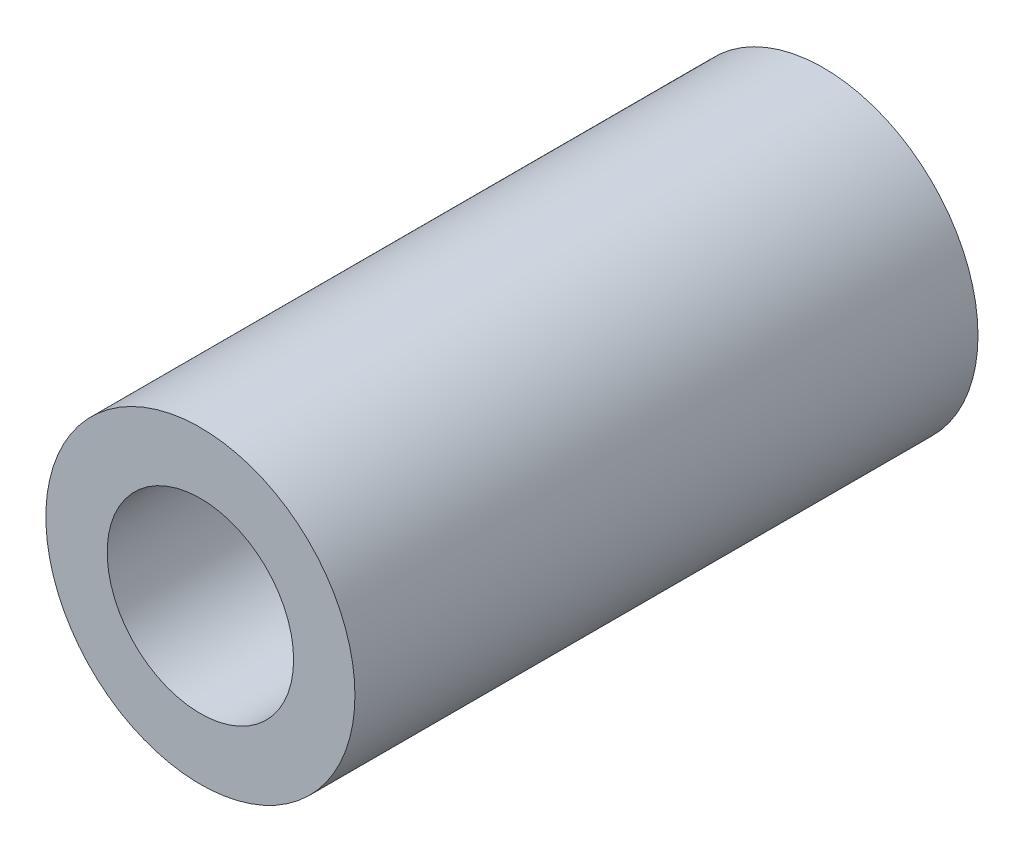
ISO-10303-21;
HEADER;
FILE_DESCRIPTION(('STEP AP214'),'2;1');
FILE_NAME('part.step','',(''),(''),'','','');
FILE_SCHEMA(('AUTOMOTIVE_DESIGN { 1 0 10303 214 1 1 1 1 }'));
ENDSEC;
DATA;
#1=APPLICATION_CONTEXT('core data for automotive mechanical design processes');
#2=APPLICATION_PROTOCOL_DEFINITION('international standard','automotive_design',2000,#1);
#3=PRODUCT_CONTEXT('',#1,'mechanical');
#4=PRODUCT('Part','Part','',(#3));
#5=PRODUCT_RELATED_PRODUCT_CATEGORY('part','',(#4));
#6=PRODUCT_DEFINITION_FORMATION('','',#4);
#7=PRODUCT_DEFINITION_CONTEXT('part definition',#1,'design');
#8=PRODUCT_DEFINITION('design','',#6,#7);
#9=PRODUCT_DEFINITION_SHAPE('','',#8);
#10=(LENGTH_UNIT() NAMED_UNIT(*) SI_UNIT(.MILLI.,.METRE.));
#11=(NAMED_UNIT(*) PLANE_ANGLE_UNIT() SI_UNIT($,.RADIAN.));
#12=(NAMED_UNIT(*) SI_UNIT($,.STERADIAN.) SOLID_ANGLE_UNIT());
#13=UNCERTAINTY_MEASURE_WITH_UNIT(LENGTH_MEASURE(1.E-05),#10,'distance_accuracy_value','');
#14=(GEOMETRIC_REPRESENTATION_CONTEXT(3) GLOBAL_UNCERTAINTY_ASSIGNED_CONTEXT((#13)) GLOBAL_UNIT_ASSIGNED_CONTEXT((#10,
#11,#12)) REPRESENTATION_CONTEXT('',''));
#15=CARTESIAN_POINT('',(0.,0.,0.));
#16=DIRECTION('',(0.,0.,1.));
#17=DIRECTION('',(1.,0.,0.));
#18=AXIS2_PLACEMENT_3D('',#15,#16,#17);
#19=CARTESIAN_POINT('',(0.,0.,127.));
#20=DIRECTION('',(0.,0.,1.));
#21=DIRECTION('',(1.,0.,0.));
#22=AXIS2_PLACEMENT_3D('',#19,#20,#21);
#23=PLANE('',#22);
#24=CARTESIAN_POINT('',(0.,0.,127.));
#25=DIRECTION('',(0.,0.,1.));
#26=DIRECTION('',(1.,0.,0.));
#27=AXIS2_PLACEMENT_3D('',#24,#25,#26);
#28=CIRCLE('',#27,31.5);
#29=CARTESIAN_POINT('',(31.5,0.,127.));
#30=VERTEX_POINT('',#29);
#31=EDGE_CURVE('E9',#30,#30,#28,.T.);
#32=ORIENTED_EDGE('',*,*,#31,.T.);
#33=EDGE_LOOP('',(#32));
#34=FACE_BOUND('',#33,.T.);
#35=CARTESIAN_POINT('',(0.,0.,127.));
#36=DIRECTION('',(0.,0.,1.));
#37=DIRECTION('',(1.,0.,0.));
#38=AXIS2_PLACEMENT_3D('',#35,#36,#37);
#39=CIRCLE('',#38,19.);
#40=CARTESIAN_POINT('',(19.,0.,127.));
#41=VERTEX_POINT('',#40);
#42=EDGE_CURVE('E25',#41,#41,#39,.T.);
#43=ORIENTED_EDGE('',*,*,#42,.F.);
#44=EDGE_LOOP('',(#43));
#45=FACE_BOUND('',#44,.T.);
#46=ADVANCED_FACE('F14',(#34,#45),#23,.T.);
#47=CARTESIAN_POINT('',(0.,0.,0.));
#48=DIRECTION('',(0.,0.,1.));
#49=DIRECTION('',(1.,0.,0.));
#50=AXIS2_PLACEMENT_3D('',#47,#48,#49);
#51=PLANE('',#50);
#52=CARTESIAN_POINT('',(0.,0.,0.));
#53=DIRECTION('',(0.,0.,1.));
#54=DIRECTION('',(1.,0.,0.));
#55=AXIS2_PLACEMENT_3D('',#52,#53,#54);
#56=CIRCLE('',#55,31.5);
#57=CARTESIAN_POINT('',(31.5,0.,0.));
#58=VERTEX_POINT('',#57);
#59=EDGE_CURVE('E18',#58,#58,#56,.T.);
#60=ORIENTED_EDGE('',*,*,#59,.F.);
#61=EDGE_LOOP('',(#60));
#62=FACE_BOUND('',#61,.T.);
#63=CARTESIAN_POINT('',(0.,0.,0.));
#64=DIRECTION('',(0.,0.,1.));
#65=DIRECTION('',(1.,0.,0.));
#66=AXIS2_PLACEMENT_3D('',#63,#64,#65);
#67=CIRCLE('',#66,19.);
#68=CARTESIAN_POINT('',(19.,0.,0.));
#69=VERTEX_POINT('',#68);
#70=EDGE_CURVE('E27',#69,#69,#67,.T.);
#71=ORIENTED_EDGE('',*,*,#70,.T.);
#72=EDGE_LOOP('',(#71));
#73=FACE_BOUND('',#72,.T.);
#74=ADVANCED_FACE('F37',(#62,#73),#51,.F.);
#75=CARTESIAN_POINT('',(0.,0.,127.));
#76=DIRECTION('',(0.,0.,-1.));
#77=DIRECTION('',(-1.,0.,0.));
#78=AXIS2_PLACEMENT_3D('',#75,#76,#77);
#79=CYLINDRICAL_SURFACE('',#78,31.5);
#80=ORIENTED_EDGE('',*,*,#31,.F.);
#81=EDGE_LOOP('',(#80));
#82=FACE_BOUND('',#81,.T.);
#83=ORIENTED_EDGE('',*,*,#59,.T.);
#84=EDGE_LOOP('',(#83));
#85=FACE_BOUND('',#84,.T.);
#86=ADVANCED_FACE('F16',(#82,#85),#79,.T.);
#87=CARTESIAN_POINT('',(0.,0.,127.));
#88=DIRECTION('',(0.,0.,-1.));
#89=DIRECTION('',(-1.,0.,0.));
#90=AXIS2_PLACEMENT_3D('',#87,#88,#89);
#91=CYLINDRICAL_SURFACE('',#90,19.);
#92=ORIENTED_EDGE('',*,*,#42,.T.);
#93=EDGE_LOOP('',(#92));
#94=FACE_BOUND('',#93,.T.);
#95=ORIENTED_EDGE('',*,*,#70,.F.);
#96=EDGE_LOOP('',(#95));
#97=FACE_BOUND('',#96,.T.);
#98=ADVANCED_FACE('F33',(#94,#97),#91,.F.);
#99=CLOSED_SHELL('',(#46,#74,#86,#98));
#100=MANIFOLD_SOLID_BREP('B1',#99);
#101=ADVANCED_BREP_SHAPE_REPRESENTATION('',(#18,#100),#14);
#102=SHAPE_DEFINITION_REPRESENTATION(#9,#101);
ENDSEC;
END-ISO-10303-21;
